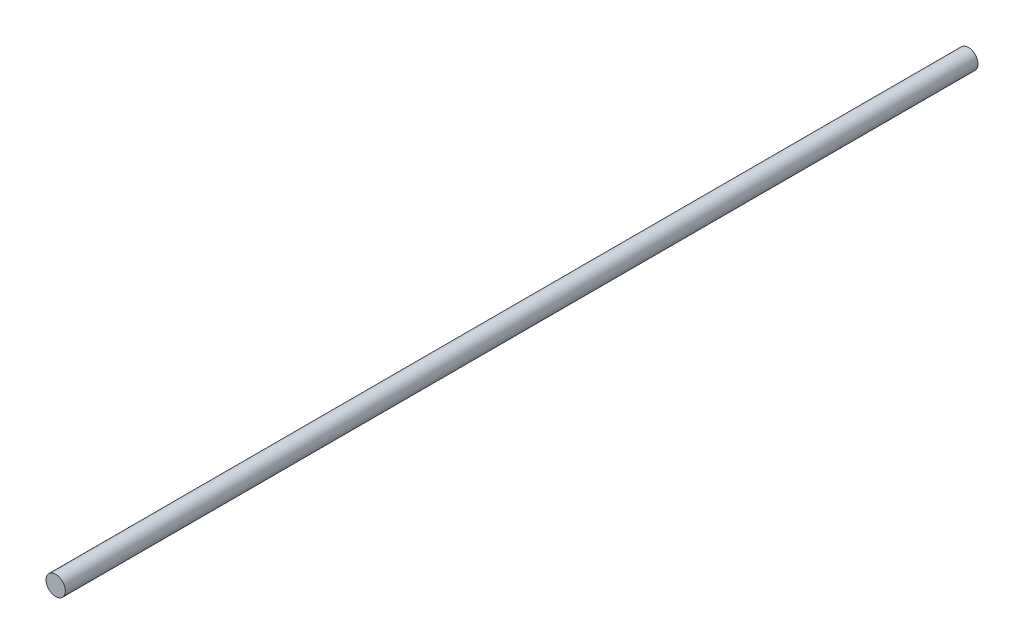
from build123d import *

# Parameters (mm, degrees)
SKETCH_1_R      = 4
EXTRUDE_1_DEPTH = 188.5


with BuildPart() as part:
    # Sketch 1 → Extrude 1 (new, symmetric)
    with BuildSketch(Plane.XY):
        Circle(SKETCH_1_R)
    extrude(amount=EXTRUDE_1_DEPTH, both=True)


solid = part.part
